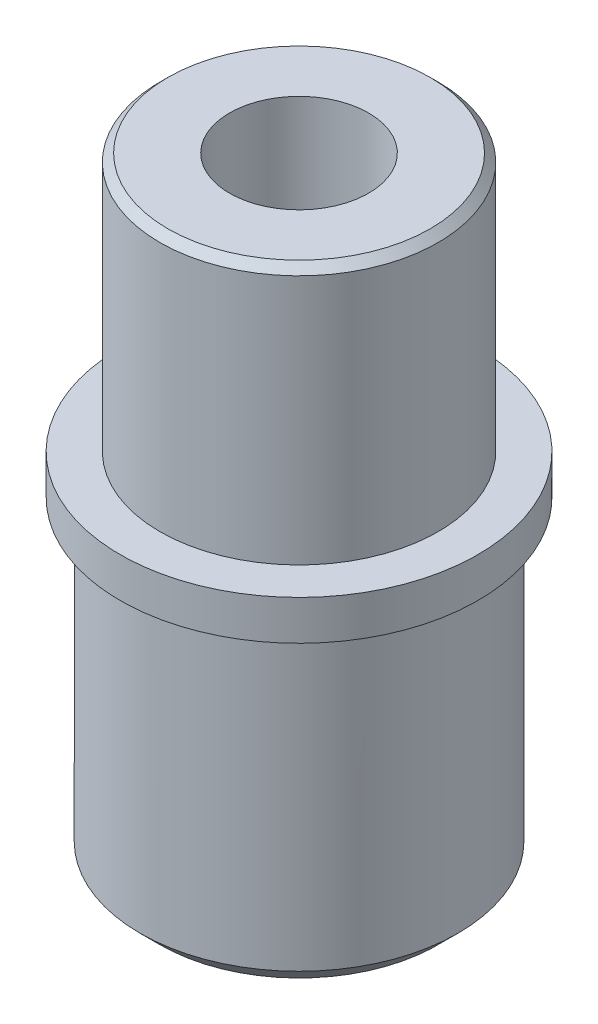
ISO-10303-21;
HEADER;
FILE_DESCRIPTION(('STEP AP214'),'2;1');
FILE_NAME('part.step','',(''),(''),'','','');
FILE_SCHEMA(('AUTOMOTIVE_DESIGN { 1 0 10303 214 1 1 1 1 }'));
ENDSEC;
DATA;
#1=APPLICATION_CONTEXT('core data for automotive mechanical design processes');
#2=APPLICATION_PROTOCOL_DEFINITION('international standard','automotive_design',2000,#1);
#3=PRODUCT_CONTEXT('',#1,'mechanical');
#4=PRODUCT('Part','Part','',(#3));
#5=PRODUCT_RELATED_PRODUCT_CATEGORY('part','',(#4));
#6=PRODUCT_DEFINITION_FORMATION('','',#4);
#7=PRODUCT_DEFINITION_CONTEXT('part definition',#1,'design');
#8=PRODUCT_DEFINITION('design','',#6,#7);
#9=PRODUCT_DEFINITION_SHAPE('','',#8);
#10=(LENGTH_UNIT() NAMED_UNIT(*) SI_UNIT(.MILLI.,.METRE.));
#11=(NAMED_UNIT(*) PLANE_ANGLE_UNIT() SI_UNIT($,.RADIAN.));
#12=(NAMED_UNIT(*) SI_UNIT($,.STERADIAN.) SOLID_ANGLE_UNIT());
#13=UNCERTAINTY_MEASURE_WITH_UNIT(LENGTH_MEASURE(1.E-05),#10,'distance_accuracy_value','');
#14=(GEOMETRIC_REPRESENTATION_CONTEXT(3) GLOBAL_UNCERTAINTY_ASSIGNED_CONTEXT((#13)) GLOBAL_UNIT_ASSIGNED_CONTEXT((#10,
#11,#12)) REPRESENTATION_CONTEXT('',''));
#15=CARTESIAN_POINT('',(0.,0.,0.));
#16=DIRECTION('',(0.,0.,1.));
#17=DIRECTION('',(1.,0.,0.));
#18=AXIS2_PLACEMENT_3D('',#15,#16,#17);
#19=CARTESIAN_POINT('',(0.,-3.49999999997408,0.));
#20=DIRECTION('',(0.,1.,0.));
#21=DIRECTION('',(0.,0.,1.));
#22=AXIS2_PLACEMENT_3D('',#19,#20,#21);
#23=CONICAL_SURFACE('',#22,1.75000000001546,1.04719755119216);
#24=CARTESIAN_POINT('',(0.,-3.5,0.));
#25=DIRECTION('',(0.,-1.,0.));
#26=DIRECTION('',(0.,0.,-1.));
#27=AXIS2_PLACEMENT_3D('',#24,#25,#26);
#28=CIRCLE('',#27,1.75);
#29=CARTESIAN_POINT('',(0.,-3.5,-1.75));
#30=VERTEX_POINT('',#29);
#31=EDGE_CURVE('P0_E88',#30,#30,#28,.F.);
#32=ORIENTED_EDGE('',*,*,#31,.T.);
#33=EDGE_LOOP('',(#32));
#34=FACE_BOUND('',#33,.T.);
#35=CARTESIAN_POINT('',(1.13686837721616E-10,-4.51036297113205,0.));
#36=VERTEX_POINT('',#35);
#37=VERTEX_LOOP('',#36);
#38=FACE_BOUND('',#37,.T.);
#39=ADVANCED_FACE('P0_F16',(#34,#38),#23,.F.);
#40=CARTESIAN_POINT('',(0.,7.275,0.));
#41=DIRECTION('',(0.,-1.,0.));
#42=DIRECTION('',(0.,0.,-1.));
#43=AXIS2_PLACEMENT_3D('',#40,#41,#42);
#44=CYLINDRICAL_SURFACE('',#43,1.75);
#45=CARTESIAN_POINT('',(0.,6.5,0.));
#46=DIRECTION('',(0.,-1.,0.));
#47=DIRECTION('',(0.,0.,-1.));
#48=AXIS2_PLACEMENT_3D('',#45,#46,#47);
#49=CIRCLE('',#48,1.75);
#50=CARTESIAN_POINT('',(0.,6.5,-1.75));
#51=VERTEX_POINT('',#50);
#52=EDGE_CURVE('P0_E19',#51,#51,#49,.F.);
#53=ORIENTED_EDGE('',*,*,#52,.T.);
#54=EDGE_LOOP('',(#53));
#55=FACE_BOUND('',#54,.T.);
#56=ORIENTED_EDGE('',*,*,#31,.F.);
#57=EDGE_LOOP('',(#56));
#58=FACE_BOUND('',#57,.T.);
#59=ADVANCED_FACE('P0_F28',(#55,#58),#44,.F.);
#60=CARTESIAN_POINT('',(0.,6.5,0.));
#61=DIRECTION('',(0.,-1.,0.));
#62=DIRECTION('',(0.,0.,-1.));
#63=AXIS2_PLACEMENT_3D('',#60,#61,#62);
#64=PLANE('',#63);
#65=ORIENTED_EDGE('',*,*,#52,.F.);
#66=EDGE_LOOP('',(#65));
#67=FACE_BOUND('',#66,.T.);
#68=CARTESIAN_POINT('',(0.,6.49999999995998,0.));
#69=DIRECTION('',(0.,-1.,0.));
#70=DIRECTION('',(0.,0.,-1.));
#71=AXIS2_PLACEMENT_3D('',#68,#69,#70);
#72=CIRCLE('',#71,3.30000000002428);
#73=CARTESIAN_POINT('',(0.,6.49999999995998,-3.30000000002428));
#74=VERTEX_POINT('',#73);
#75=EDGE_CURVE('P0_E82',#74,#74,#72,.T.);
#76=ORIENTED_EDGE('',*,*,#75,.F.);
#77=EDGE_LOOP('',(#76));
#78=FACE_BOUND('',#77,.T.);
#79=ADVANCED_FACE('P0_F34',(#67,#78),#64,.F.);
#80=CARTESIAN_POINT('',(0.,6.30000000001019,0.));
#81=DIRECTION('',(0.,-1.,0.));
#82=DIRECTION('',(0.,0.,-1.));
#83=AXIS2_PLACEMENT_3D('',#80,#81,#82);
#84=CONICAL_SURFACE('',#83,3.49999999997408,0.785398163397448);
#85=CARTESIAN_POINT('',(0.,6.3,0.));
#86=DIRECTION('',(0.,-1.,0.));
#87=DIRECTION('',(0.,0.,-1.));
#88=AXIS2_PLACEMENT_3D('',#85,#86,#87);
#89=CIRCLE('',#88,3.5);
#90=CARTESIAN_POINT('',(0.,6.3,-3.5));
#91=VERTEX_POINT('',#90);
#92=EDGE_CURVE('P0_E84',#91,#91,#89,.T.);
#93=ORIENTED_EDGE('',*,*,#92,.F.);
#94=EDGE_LOOP('',(#93));
#95=FACE_BOUND('',#94,.T.);
#96=ORIENTED_EDGE('',*,*,#75,.T.);
#97=EDGE_LOOP('',(#96));
#98=FACE_BOUND('',#97,.T.);
#99=ADVANCED_FACE('P0_F68',(#95,#98),#84,.T.);
#100=CARTESIAN_POINT('',(0.,7.275,0.));
#101=DIRECTION('',(0.,-1.,0.));
#102=DIRECTION('',(0.,0.,-1.));
#103=AXIS2_PLACEMENT_3D('',#100,#101,#102);
#104=CYLINDRICAL_SURFACE('',#103,3.5);
#105=CARTESIAN_POINT('',(0.,0.,0.));
#106=DIRECTION('',(0.,-1.,0.));
#107=DIRECTION('',(0.,0.,-1.));
#108=AXIS2_PLACEMENT_3D('',#105,#106,#107);
#109=CIRCLE('',#108,3.5);
#110=CARTESIAN_POINT('',(0.,0.,-3.5));
#111=VERTEX_POINT('',#110);
#112=EDGE_CURVE('P0_E86',#111,#111,#109,.F.);
#113=ORIENTED_EDGE('',*,*,#112,.T.);
#114=EDGE_LOOP('',(#113));
#115=FACE_BOUND('',#114,.T.);
#116=ORIENTED_EDGE('',*,*,#92,.T.);
#117=EDGE_LOOP('',(#116));
#118=FACE_BOUND('',#117,.T.);
#119=ADVANCED_FACE('P0_F64',(#115,#118),#104,.T.);
#120=CARTESIAN_POINT('',(0.,0.,0.));
#121=DIRECTION('',(0.,-1.,0.));
#122=DIRECTION('',(0.,0.,-1.));
#123=AXIS2_PLACEMENT_3D('',#120,#121,#122);
#124=PLANE('',#123);
#125=ORIENTED_EDGE('',*,*,#112,.F.);
#126=EDGE_LOOP('',(#125));
#127=FACE_BOUND('',#126,.T.);
#128=CARTESIAN_POINT('',(0.,0.,0.));
#129=DIRECTION('',(0.,-1.,0.));
#130=DIRECTION('',(0.,0.,-1.));
#131=AXIS2_PLACEMENT_3D('',#128,#129,#130);
#132=CIRCLE('',#131,4.5);
#133=CARTESIAN_POINT('',(0.,0.,-4.5));
#134=VERTEX_POINT('',#133);
#135=EDGE_CURVE('P0_E92',#134,#134,#132,.T.);
#136=ORIENTED_EDGE('',*,*,#135,.F.);
#137=EDGE_LOOP('',(#136));
#138=FACE_BOUND('',#137,.T.);
#139=ADVANCED_FACE('P0_F60',(#127,#138),#124,.F.);
#140=CARTESIAN_POINT('',(0.,7.275,0.));
#141=DIRECTION('',(0.,-1.,0.));
#142=DIRECTION('',(0.,0.,-1.));
#143=AXIS2_PLACEMENT_3D('',#140,#141,#142);
#144=CYLINDRICAL_SURFACE('',#143,4.5);
#145=ORIENTED_EDGE('',*,*,#135,.T.);
#146=EDGE_LOOP('',(#145));
#147=FACE_BOUND('',#146,.T.);
#148=CARTESIAN_POINT('',(0.,-1.,0.));
#149=DIRECTION('',(0.,-1.,0.));
#150=DIRECTION('',(0.,0.,-1.));
#151=AXIS2_PLACEMENT_3D('',#148,#149,#150);
#152=CIRCLE('',#151,4.5);
#153=CARTESIAN_POINT('',(0.,-1.,-4.5));
#154=VERTEX_POINT('',#153);
#155=EDGE_CURVE('P0_E95',#154,#154,#152,.T.);
#156=ORIENTED_EDGE('',*,*,#155,.F.);
#157=EDGE_LOOP('',(#156));
#158=FACE_BOUND('',#157,.T.);
#159=ADVANCED_FACE('P0_F56',(#147,#158),#144,.T.);
#160=CARTESIAN_POINT('',(0.,-9.,0.));
#161=DIRECTION('',(0.,-1.,0.));
#162=DIRECTION('',(0.,0.,-1.));
#163=AXIS2_PLACEMENT_3D('',#160,#161,#162);
#164=PLANE('',#163);
#165=CARTESIAN_POINT('',(0.,-9.0000000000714,0.));
#166=DIRECTION('',(0.,1.,0.));
#167=DIRECTION('',(0.,0.,1.));
#168=AXIS2_PLACEMENT_3D('',#165,#166,#167);
#169=CIRCLE('',#168,3.50000000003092);
#170=CARTESIAN_POINT('',(0.,-9.0000000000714,3.50000000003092));
#171=VERTEX_POINT('',#170);
#172=EDGE_CURVE('P0_E98',#171,#171,#169,.T.);
#173=ORIENTED_EDGE('',*,*,#172,.F.);
#174=EDGE_LOOP('',(#173));
#175=FACE_BOUND('',#174,.T.);
#176=ADVANCED_FACE('P0_F52',(#175),#164,.T.);
#177=CARTESIAN_POINT('',(0.,-1.,0.));
#178=DIRECTION('',(0.,-1.,0.));
#179=DIRECTION('',(0.,0.,-1.));
#180=AXIS2_PLACEMENT_3D('',#177,#178,#179);
#181=PLANE('',#180);
#182=CARTESIAN_POINT('',(0.,-1.,0.));
#183=DIRECTION('',(0.,-1.,0.));
#184=DIRECTION('',(0.,0.,-1.));
#185=AXIS2_PLACEMENT_3D('',#182,#183,#184);
#186=CIRCLE('',#185,4.);
#187=CARTESIAN_POINT('',(0.,-1.,-4.));
#188=VERTEX_POINT('',#187);
#189=EDGE_CURVE('P0_E23',#188,#188,#186,.T.);
#190=ORIENTED_EDGE('',*,*,#189,.F.);
#191=EDGE_LOOP('',(#190));
#192=FACE_BOUND('',#191,.T.);
#193=ORIENTED_EDGE('',*,*,#155,.T.);
#194=EDGE_LOOP('',(#193));
#195=FACE_BOUND('',#194,.T.);
#196=ADVANCED_FACE('P0_F45',(#192,#195),#181,.T.);
#197=CARTESIAN_POINT('',(0.,-8.50000000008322,0.));
#198=DIRECTION('',(0.,1.,0.));
#199=DIRECTION('',(0.,0.,1.));
#200=AXIS2_PLACEMENT_3D('',#197,#198,#199);
#201=CONICAL_SURFACE('',#200,4.0000000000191,0.785398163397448);
#202=ORIENTED_EDGE('',*,*,#172,.T.);
#203=EDGE_LOOP('',(#202));
#204=FACE_BOUND('',#203,.T.);
#205=CARTESIAN_POINT('',(0.,-8.5,0.));
#206=DIRECTION('',(0.,-1.,0.));
#207=DIRECTION('',(0.,0.,-1.));
#208=AXIS2_PLACEMENT_3D('',#205,#206,#207);
#209=CIRCLE('',#208,4.);
#210=CARTESIAN_POINT('',(0.,-8.5,-4.));
#211=VERTEX_POINT('',#210);
#212=EDGE_CURVE('P0_E11',#211,#211,#209,.F.);
#213=ORIENTED_EDGE('',*,*,#212,.F.);
#214=EDGE_LOOP('',(#213));
#215=FACE_BOUND('',#214,.T.);
#216=ADVANCED_FACE('P0_F39',(#204,#215),#201,.T.);
#217=CARTESIAN_POINT('',(0.,7.275,0.));
#218=DIRECTION('',(0.,-1.,0.));
#219=DIRECTION('',(0.,0.,-1.));
#220=AXIS2_PLACEMENT_3D('',#217,#218,#219);
#221=CYLINDRICAL_SURFACE('',#220,4.);
#222=ORIENTED_EDGE('',*,*,#212,.T.);
#223=EDGE_LOOP('',(#222));
#224=FACE_BOUND('',#223,.T.);
#225=ORIENTED_EDGE('',*,*,#189,.T.);
#226=EDGE_LOOP('',(#225));
#227=FACE_BOUND('',#226,.T.);
#228=ADVANCED_FACE('P0_F37',(#224,#227),#221,.T.);
#229=CLOSED_SHELL('',(#39,#59,#79,#99,#119,#139,#159,#176,#196,#216,#228));
#230=MANIFOLD_SOLID_BREP('P0_B1',#229);
#231=CARTESIAN_POINT('',(0.,6.5,0.));
#232=DIRECTION('',(0.,1.,0.));
#233=DIRECTION('',(0.,0.,1.));
#234=AXIS2_PLACEMENT_3D('',#231,#232,#233);
#235=CYLINDRICAL_SURFACE('',#234,2.);
#236=CARTESIAN_POINT('',(0.,-1.5,0.));
#237=DIRECTION('',(0.,1.,0.));
#238=DIRECTION('',(0.,0.,1.));
#239=AXIS2_PLACEMENT_3D('',#236,#237,#238);
#240=CIRCLE('',#239,2.);
#241=CARTESIAN_POINT('',(0.,-1.5,2.));
#242=VERTEX_POINT('',#241);
#243=EDGE_CURVE('P1_E20',#242,#242,#240,.T.);
#244=ORIENTED_EDGE('',*,*,#243,.T.);
#245=EDGE_LOOP('',(#244));
#246=FACE_BOUND('',#245,.T.);
#247=CARTESIAN_POINT('',(0.,6.5,0.));
#248=DIRECTION('',(0.,1.,0.));
#249=DIRECTION('',(0.,0.,1.));
#250=AXIS2_PLACEMENT_3D('',#247,#248,#249);
#251=CIRCLE('',#250,2.);
#252=CARTESIAN_POINT('',(0.,6.5,2.));
#253=VERTEX_POINT('',#252);
#254=EDGE_CURVE('P1_E11',#253,#253,#251,.F.);
#255=ORIENTED_EDGE('',*,*,#254,.T.);
#256=EDGE_LOOP('',(#255));
#257=FACE_BOUND('',#256,.T.);
#258=ADVANCED_FACE('P1_F16',(#246,#257),#235,.T.);
#259=CARTESIAN_POINT('',(0.,-1.5,0.));
#260=DIRECTION('',(0.,1.,0.));
#261=DIRECTION('',(0.,0.,1.));
#262=AXIS2_PLACEMENT_3D('',#259,#260,#261);
#263=PLANE('',#262);
#264=CARTESIAN_POINT('',(1.75,-1.5,0.));
#265=CARTESIAN_POINT('',(1.74979751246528,-1.5,0.334045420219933));
#266=CARTESIAN_POINT('',(1.62712952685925,-1.5,0.644165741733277));
#267=CARTESIAN_POINT('',(1.49401203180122,-1.5,0.980703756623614));
#268=CARTESIAN_POINT('',(1.23743686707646,-1.5,1.23743686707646));
#269=CARTESIAN_POINT('',(0.981606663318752,-1.5,1.49342455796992));
#270=CARTESIAN_POINT('',(0.644165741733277,-1.5,1.62712952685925));
#271=CARTESIAN_POINT('',(0.334324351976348,-1.5,1.74989867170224));
#272=CARTESIAN_POINT('',(0.,-1.5,1.75));
#273=CARTESIAN_POINT('',(-0.333278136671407,-1.5,1.75010101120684));
#274=CARTESIAN_POINT('',(-0.644165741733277,-1.5,1.62712952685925));
#275=CARTESIAN_POINT('',(-0.98070375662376,-1.5,1.49401203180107));
#276=CARTESIAN_POINT('',(-1.23743686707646,-1.5,1.23743686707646));
#277=CARTESIAN_POINT('',(-1.49342455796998,-1.5,0.981606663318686));
#278=CARTESIAN_POINT('',(-1.62712952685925,-1.5,0.644165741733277));
#279=CARTESIAN_POINT('',(-1.74979718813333,-1.5,0.334580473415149));
#280=CARTESIAN_POINT('',(-1.75,-1.5,0.));
#281=B_SPLINE_CURVE_WITH_KNOTS('',2,(#264,#265,#266,#267,#268,#269,#270,#271,#272,#273,#274,
#275,#276,#277,#278,#279,#280),.UNSPECIFIED.,.F.,.F.,(3,2,2,2,2,2,2,2,3),(0.,0.125,0.25,0.375,
0.5,0.625,0.75,0.875,1.),.UNSPECIFIED.);
#282=CARTESIAN_POINT('',(1.75,-1.5,0.));
#283=VERTEX_POINT('',#282);
#284=CARTESIAN_POINT('',(-1.75,-1.5,0.));
#285=VERTEX_POINT('',#284);
#286=EDGE_CURVE('P1_E28',#283,#285,#281,.T.);
#287=ORIENTED_EDGE('',*,*,#286,.F.);
#288=CARTESIAN_POINT('',(-1.75,-1.5,0.));
#289=CARTESIAN_POINT('',(-1.74979751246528,-1.5,-0.334045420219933));
#290=CARTESIAN_POINT('',(-1.62712952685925,-1.5,-0.644165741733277));
#291=CARTESIAN_POINT('',(-1.49401203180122,-1.5,-0.980703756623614));
#292=CARTESIAN_POINT('',(-1.23743686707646,-1.5,-1.23743686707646));
#293=CARTESIAN_POINT('',(-0.981606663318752,-1.5,-1.49342455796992));
#294=CARTESIAN_POINT('',(-0.644165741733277,-1.5,-1.62712952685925));
#295=CARTESIAN_POINT('',(-0.334324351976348,-1.5,-1.74989867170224));
#296=CARTESIAN_POINT('',(0.,-1.5,-1.75));
#297=CARTESIAN_POINT('',(0.333278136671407,-1.5,-1.75010101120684));
#298=CARTESIAN_POINT('',(0.644165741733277,-1.5,-1.62712952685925));
#299=CARTESIAN_POINT('',(0.98070375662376,-1.5,-1.49401203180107));
#300=CARTESIAN_POINT('',(1.23743686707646,-1.5,-1.23743686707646));
#301=CARTESIAN_POINT('',(1.49342455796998,-1.5,-0.981606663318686));
#302=CARTESIAN_POINT('',(1.62712952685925,-1.5,-0.644165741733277));
#303=CARTESIAN_POINT('',(1.74979718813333,-1.5,-0.334580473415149));
#304=CARTESIAN_POINT('',(1.75,-1.5,0.));
#305=B_SPLINE_CURVE_WITH_KNOTS('',2,(#288,#289,#290,#291,#292,#293,#294,#295,#296,#297,#298,
#299,#300,#301,#302,#303,#304),.UNSPECIFIED.,.F.,.F.,(3,2,2,2,2,2,2,2,3),(0.,0.125,0.25,0.375,
0.5,0.625,0.75,0.875,1.),.UNSPECIFIED.);
#306=EDGE_CURVE('P1_E33',#285,#283,#305,.T.);
#307=ORIENTED_EDGE('',*,*,#306,.F.);
#308=EDGE_LOOP('',(#287,#307));
#309=FACE_BOUND('',#308,.T.);
#310=ORIENTED_EDGE('',*,*,#243,.F.);
#311=EDGE_LOOP('',(#310));
#312=FACE_BOUND('',#311,.T.);
#313=ADVANCED_FACE('P1_F17',(#309,#312),#263,.F.);
#314=OPEN_SHELL('',(#258,#313));
#315=SHELL_BASED_SURFACE_MODEL('P1_B1',(#314));
#316=ADVANCED_BREP_SHAPE_REPRESENTATION('',(#18,#230),#14);
#317=MANIFOLD_SURFACE_SHAPE_REPRESENTATION('',(#18,#315),#14);
#318=SHAPE_REPRESENTATION('',(#18),#14);
#319=SHAPE_DEFINITION_REPRESENTATION(#9,#318);
#320=SHAPE_REPRESENTATION_RELATIONSHIP('','',#318,#316);
#321=SHAPE_REPRESENTATION_RELATIONSHIP('','',#318,#317);
ENDSEC;
END-ISO-10303-21;
